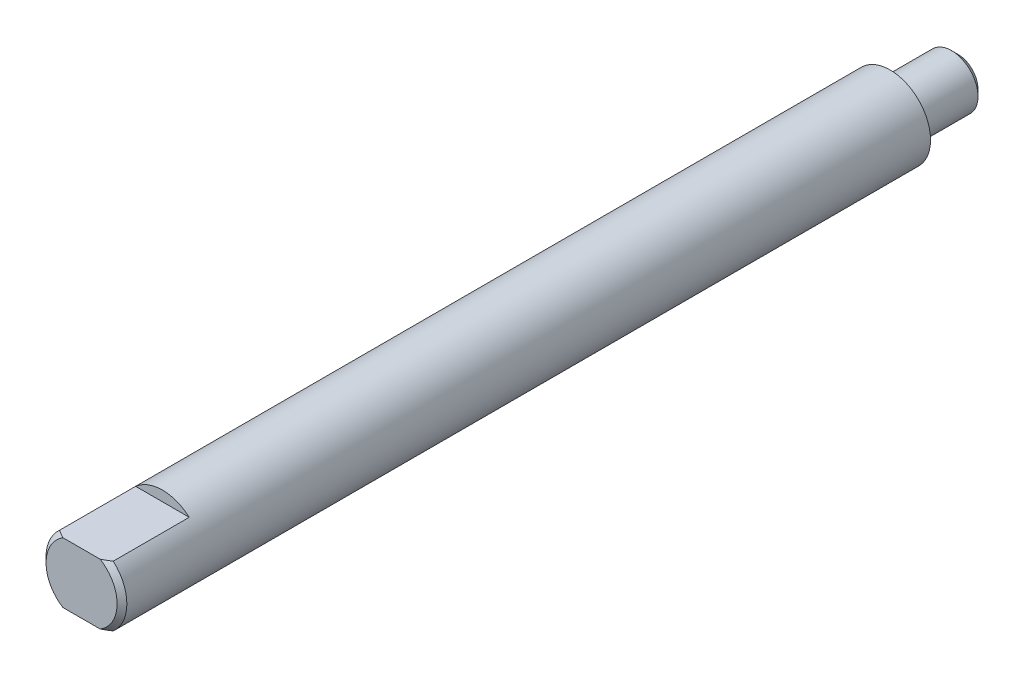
from build123d import *

# Parameters (mm, degrees)
SKETCH2_W          = 6.35
SKETCH2_H          = 0.8
CUT_EXTRUDE1_DEPTH = 5


with BuildPart() as part:
    # Sketch1 → Revolve1 (revolve)
    with BuildSketch(Plane(origin=(0, 0, 0), x_dir=(0, 0, -1), z_dir=(1, 0, 0)), mode=Mode.PRIVATE) as revolve1_sk:
        Polygon((64.766, 1.5728), (64.256, 2.0828), (59.436, 2.0828), (59.436, 3.175), (-3.684, 3.175), (-4.064, 2.79), (-4.064, 0), (64.766, 0), align=None)
    revolve(revolve1_sk.sketch.rotate(Axis((0, 0, 4.064), (0, 0, -1)), 90), axis=Axis((0, 0, 4.064), (0, 0, -1)))

    # Sketch2 → Cut-Extrude1 (cut, symmetric)
    with BuildSketch(Plane(origin=(0, 0, 0), x_dir=(0, 0, -1), z_dir=(1, 0, 0))):
        with Locations((-0.889, 2.775)):
            Rectangle(SKETCH2_W, SKETCH2_H)
        with Locations((-0.889, -2.775)):
            Rectangle(SKETCH2_W, SKETCH2_H)
    extrude(amount=CUT_EXTRUDE1_DEPTH, both=True, mode=Mode.SUBTRACT)


solid = part.part
